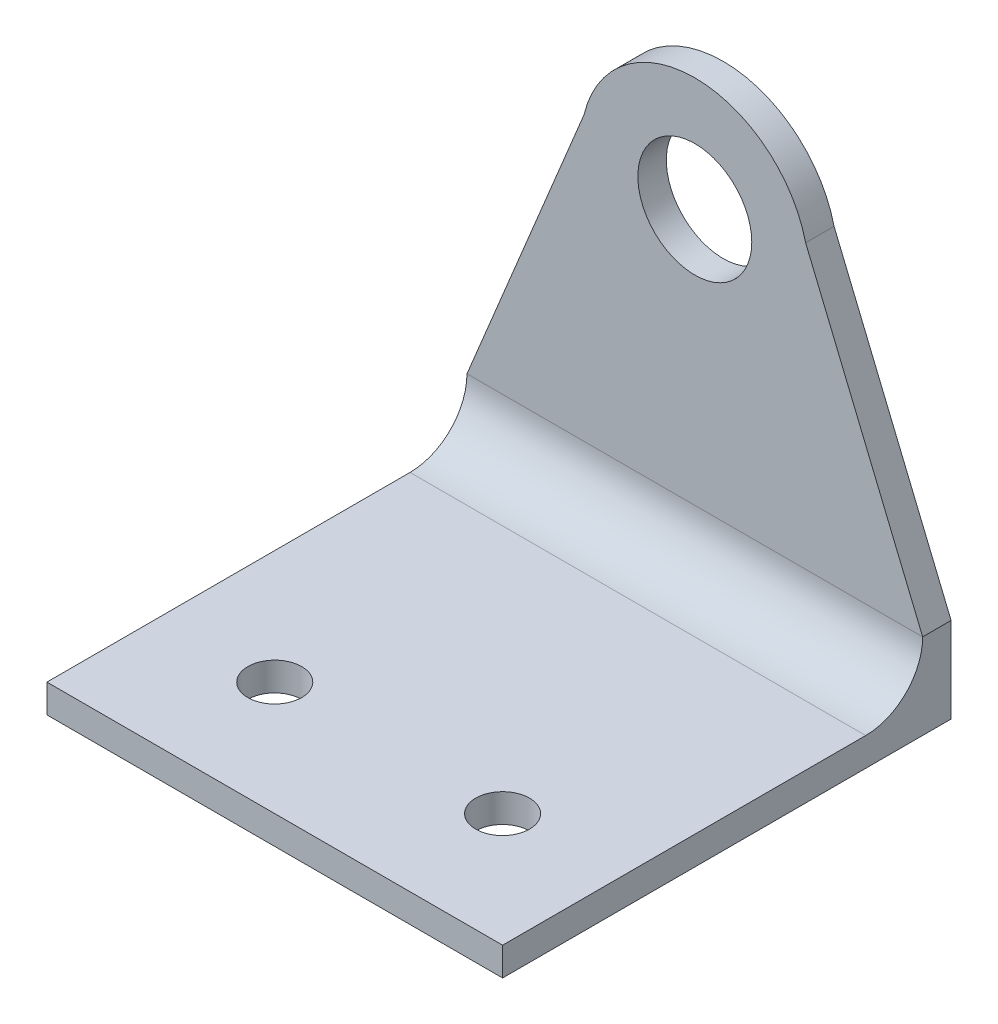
from build123d import *

# Parameters (mm, degrees)
BOSS_EXTRUDE2_DEPTH      = 25.4
FILLET2_R                = 6.35
F_6_0_6_DIAMETER_HOLE2_D = 6
SKETCH15_R               = 6.35
CUT_EXTRUDE1_DEPTH       = 74.612831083
CUT_EXTRUDE2_DEPTH       = 74.612831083


with BuildPart() as part:
    # Sketch1 → Boss-Extrude2 (new, symmetric)
    with BuildSketch(Plane(origin=(0, 0, 0), x_dir=(0, 0, -1), z_dir=(1, 0, 0))):
        Polygon((0, 0), (50, 0), (50, 50.8), (46.83, 50.8), (46.83, 3.17), (0, 3.17), align=None)
    extrude(amount=BOSS_EXTRUDE2_DEPTH, both=True)

    # Fillet2
    fillet2_edges = [part.edges().sort_by_distance(p)[0] for p in [
        (0, 3.17, -46.83),
    ]]
    fillet(fillet2_edges, radius=FILLET2_R)

    # 6.0 _6_ Diameter Hole2 (through all)
    with Locations(Plane(origin=(0, 3.17, 0), x_dir=(-1, 0, 0), z_dir=(0, 1, 0))):
        with Locations((12.7, -12.7), (-12.7, -12.7)):
            Hole(F_6_0_6_DIAMETER_HOLE2_D / 2)

    # Sketch15 → Cut-Extrude1 (cut, through all)
    with BuildSketch(Plane.XY.offset(-46.83)):
        with Locations((0, 38.1)):
            Circle(SKETCH15_R)
    extrude(amount=-CUT_EXTRUDE1_DEPTH, mode=Mode.SUBTRACT)

    # Sketch14 → Cut-Extrude2 (cut, through all)
    with BuildSketch(Plane.XY.offset(-46.83)):
        with BuildLine():
            Line((-25.4, 50.8), (-25.4, 9.52))
            Line((-25.4, 9.52), (-12.354609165, 41.041705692))
            ThreePointArc((-12.354609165, 41.041705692), (-7.871795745, 48.066184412), (9.7e-08, 50.8))
            Line((9.7e-08, 50.8), (-25.4, 50.8))
        make_face()
        with BuildLine():
            Line((12.354609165, 41.041705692), (25.4, 9.52))
            Line((25.4, 9.52), (25.4, 50.8))
            Line((25.4, 50.8), (9.7e-08, 50.8))
            ThreePointArc((9.7e-08, 50.8), (7.871795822, 48.066184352), (12.354609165, 41.041705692))
        make_face()
    extrude(amount=-CUT_EXTRUDE2_DEPTH, mode=Mode.SUBTRACT)


solid = part.part
